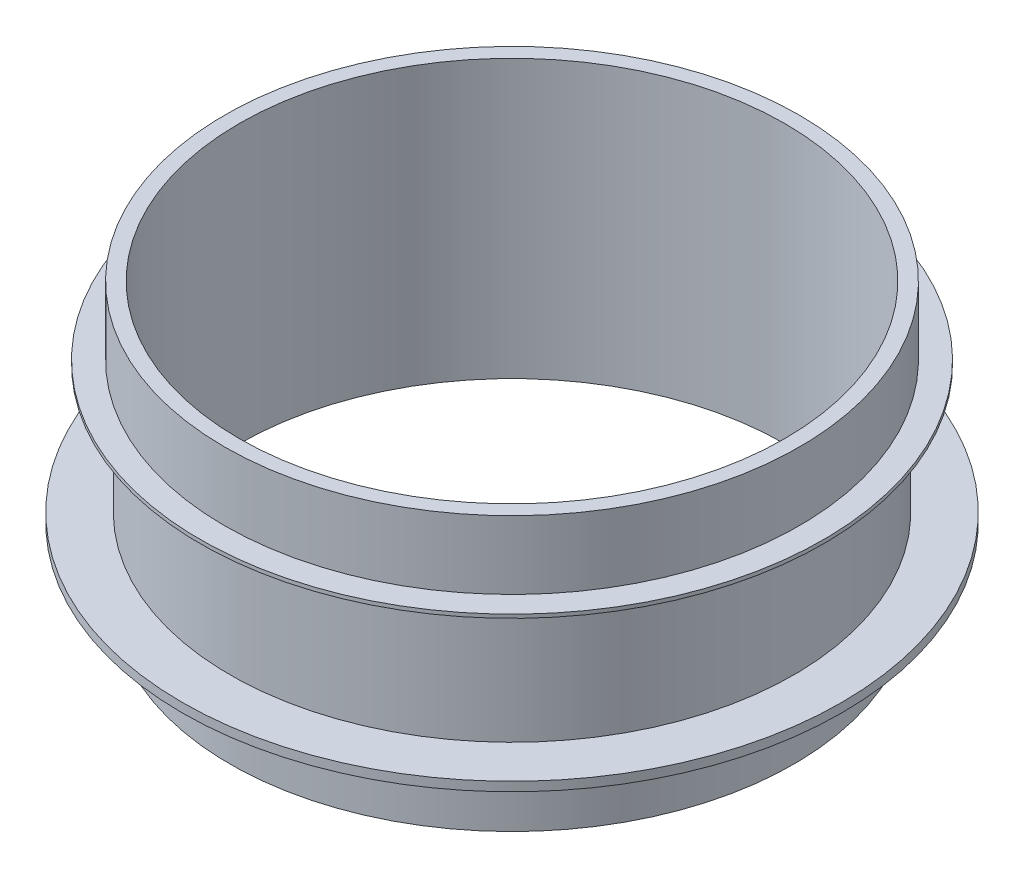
from build123d import *

# Parameters (mm, degrees)
ESQUISSE1_R      = 62
ESQUISSE1_R_2    = 60
EXTRUSION1_DEPTH = 61
ESQUISSE2_R      = 72.5
ESQUISSE2_R_2    = 62
EXTRUSION2_DEPTH = 2
EXTRUSION3_START = -15
ESQUISSE4_R      = 63.2
ESQUISSE4_R_2    = 60
EXTRUSION3_DEPTH = 15
EXTRUSION4_START = 0.8
ESQUISSE5_R      = 68.5
ESQUISSE5_R_2    = 63.2
EXTRUSION4_DEPTH = 0.8


with BuildPart() as part:
    # Esquisse1 → Extrusion1 (new body)
    with BuildSketch(Plane(origin=(0, 0, 0), x_dir=(1, 0, 0), z_dir=(0, 1, 0))):
        with Locations(Location((0, 0, 0), (0, 0, 90))):
            Circle(ESQUISSE1_R)
        with Locations(Location((0, 0, 0), (0, 0, 90))):
            Circle(ESQUISSE1_R_2, mode=Mode.SUBTRACT)
    extrude(amount=EXTRUSION1_DEPTH)

    # Esquisse2 → Extrusion2 (add)
    with BuildSketch(Plane.XZ.offset(-15)):
        with Locations(Location((0, 0, 0), (0, 0, 270))):
            Circle(ESQUISSE2_R)
        with Locations(Location((0, 0, 0), (0, 0, 270))):
            Circle(ESQUISSE2_R_2, mode=Mode.SUBTRACT)
    extrude(amount=-EXTRUSION2_DEPTH)

    # Esquisse4 → Extrusion3 (add)
    with BuildSketch(Plane(origin=(0, 61, 0), x_dir=(-1, 0, 0), z_dir=(0, 1, 0)).offset(EXTRUSION3_START)):
        with Locations(Location((0, 0, 0), (0, 0, 90))):
            Circle(ESQUISSE4_R)
        with Locations(Location((0, 0, 0), (0, 0, 270))):
            Circle(ESQUISSE4_R_2, mode=Mode.SUBTRACT)
    extrude(amount=EXTRUSION3_DEPTH)


with BuildPart() as body_2:
    # Esquisse5 → Extrusion4 (new body)
    with BuildSketch(Plane.XZ.offset(-46).offset(EXTRUSION4_START)):
        with Locations(Location((0, 0, 0), (0, 0, 270))):
            Circle(ESQUISSE5_R)
        with Locations(Location((0, 0, 0), (0, 0, 270))):
            Circle(ESQUISSE5_R_2, mode=Mode.SUBTRACT)
    extrude(amount=-EXTRUSION4_DEPTH)


solid = Compound([part.part, body_2.part])
